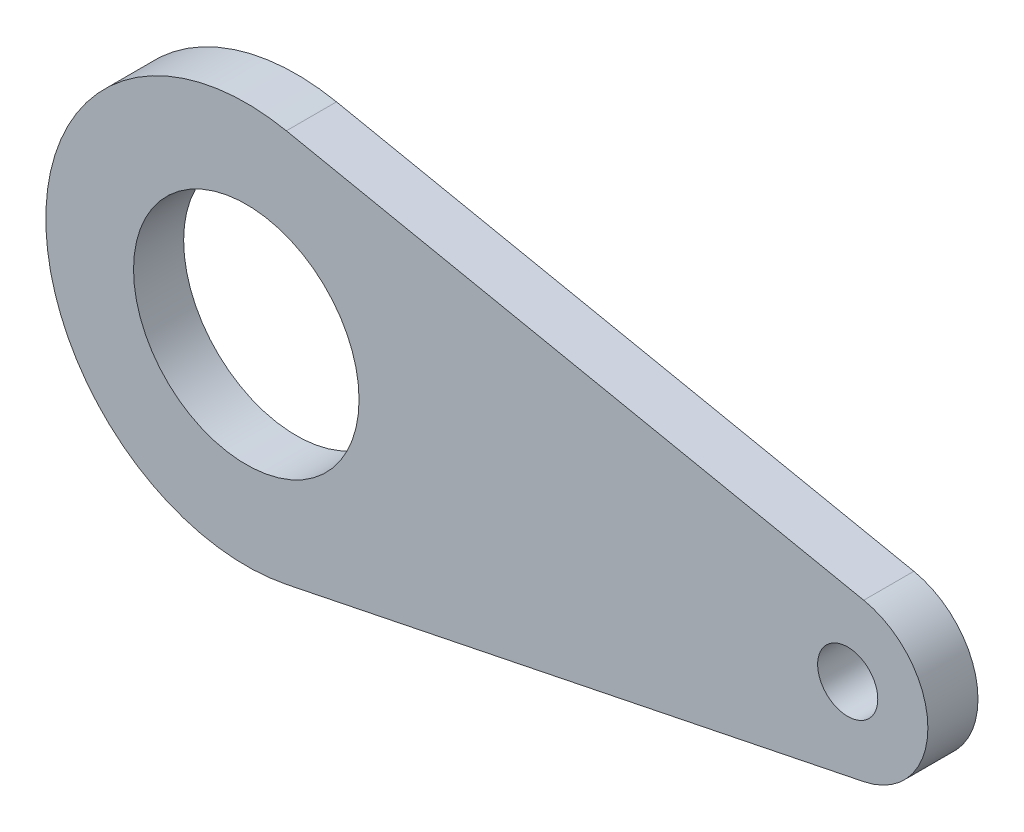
ISO-10303-21;
HEADER;
FILE_DESCRIPTION(('STEP AP214'),'2;1');
FILE_NAME('part.step','',(''),(''),'','','');
FILE_SCHEMA(('AUTOMOTIVE_DESIGN { 1 0 10303 214 1 1 1 1 }'));
ENDSEC;
DATA;
#1=APPLICATION_CONTEXT('core data for automotive mechanical design processes');
#2=APPLICATION_PROTOCOL_DEFINITION('international standard','automotive_design',2000,#1);
#3=PRODUCT_CONTEXT('',#1,'mechanical');
#4=PRODUCT('Part','Part','',(#3));
#5=PRODUCT_RELATED_PRODUCT_CATEGORY('part','',(#4));
#6=PRODUCT_DEFINITION_FORMATION('','',#4);
#7=PRODUCT_DEFINITION_CONTEXT('part definition',#1,'design');
#8=PRODUCT_DEFINITION('design','',#6,#7);
#9=PRODUCT_DEFINITION_SHAPE('','',#8);
#10=(LENGTH_UNIT() NAMED_UNIT(*) SI_UNIT(.MILLI.,.METRE.));
#11=(NAMED_UNIT(*) PLANE_ANGLE_UNIT() SI_UNIT($,.RADIAN.));
#12=(NAMED_UNIT(*) SI_UNIT($,.STERADIAN.) SOLID_ANGLE_UNIT());
#13=UNCERTAINTY_MEASURE_WITH_UNIT(LENGTH_MEASURE(1.E-05),#10,'distance_accuracy_value','');
#14=(GEOMETRIC_REPRESENTATION_CONTEXT(3) GLOBAL_UNCERTAINTY_ASSIGNED_CONTEXT((#13)) GLOBAL_UNIT_ASSIGNED_CONTEXT((#10,
#11,#12)) REPRESENTATION_CONTEXT('',''));
#15=CARTESIAN_POINT('',(0.,0.,0.));
#16=DIRECTION('',(0.,0.,1.));
#17=DIRECTION('',(1.,0.,0.));
#18=AXIS2_PLACEMENT_3D('',#15,#16,#17);
#19=CARTESIAN_POINT('',(0.,0.,5.));
#20=DIRECTION('',(0.,0.,1.));
#21=DIRECTION('',(1.,0.,0.));
#22=AXIS2_PLACEMENT_3D('',#19,#20,#21);
#23=PLANE('',#22);
#24=CARTESIAN_POINT('',(120.,0.,5.));
#25=DIRECTION('',(0.,0.,1.));
#26=DIRECTION('',(1.,0.,0.));
#27=AXIS2_PLACEMENT_3D('',#24,#25,#26);
#28=CIRCLE('',#27,6.00000000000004);
#29=CARTESIAN_POINT('',(126.,0.,5.));
#30=VERTEX_POINT('',#29);
#31=EDGE_CURVE('E90',#30,#30,#28,.T.);
#32=ORIENTED_EDGE('',*,*,#31,.F.);
#33=EDGE_LOOP('',(#32));
#34=FACE_BOUND('',#33,.T.);
#35=CARTESIAN_POINT('',(0.,0.,5.));
#36=DIRECTION('',(0.,0.,1.));
#37=DIRECTION('',(1.,0.,0.));
#38=AXIS2_PLACEMENT_3D('',#35,#36,#37);
#39=CIRCLE('',#38,40.);
#40=CARTESIAN_POINT('',(8.00000000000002,39.1918358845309,5.));
#41=VERTEX_POINT('',#40);
#42=CARTESIAN_POINT('',(8.00000000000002,-39.1918358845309,5.));
#43=VERTEX_POINT('',#42);
#44=EDGE_CURVE('E100',#41,#43,#39,.T.);
#45=ORIENTED_EDGE('',*,*,#44,.T.);
#46=DIRECTION('',(0.979795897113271,0.2,0.));
#47=VECTOR('',#46,1.);
#48=CARTESIAN_POINT('',(8.00000000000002,-39.1918358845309,5.));
#49=LINE('',#48,#47);
#50=CARTESIAN_POINT('',(123.2,-15.6767343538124,5.));
#51=VERTEX_POINT('',#50);
#52=EDGE_CURVE('E85',#43,#51,#49,.T.);
#53=ORIENTED_EDGE('',*,*,#52,.T.);
#54=CARTESIAN_POINT('',(120.,0.,5.));
#55=DIRECTION('',(0.,0.,1.));
#56=DIRECTION('',(1.,0.,0.));
#57=AXIS2_PLACEMENT_3D('',#54,#55,#56);
#58=CIRCLE('',#57,16.);
#59=CARTESIAN_POINT('',(123.2,15.6767343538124,5.));
#60=VERTEX_POINT('',#59);
#61=EDGE_CURVE('E51',#51,#60,#58,.T.);
#62=ORIENTED_EDGE('',*,*,#61,.T.);
#63=DIRECTION('',(-0.979795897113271,0.2,0.));
#64=VECTOR('',#63,1.);
#65=CARTESIAN_POINT('',(8.00000000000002,39.1918358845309,5.));
#66=LINE('',#65,#64);
#67=EDGE_CURVE('E46',#60,#41,#66,.T.);
#68=ORIENTED_EDGE('',*,*,#67,.T.);
#69=EDGE_LOOP('',(#45,#53,#62,#68));
#70=FACE_BOUND('',#69,.T.);
#71=CARTESIAN_POINT('',(0.,0.,5.));
#72=DIRECTION('',(0.,0.,1.));
#73=DIRECTION('',(1.,0.,0.));
#74=AXIS2_PLACEMENT_3D('',#71,#72,#73);
#75=CIRCLE('',#74,22.5);
#76=CARTESIAN_POINT('',(22.5,0.,5.));
#77=VERTEX_POINT('',#76);
#78=EDGE_CURVE('E118',#77,#77,#75,.T.);
#79=ORIENTED_EDGE('',*,*,#78,.F.);
#80=EDGE_LOOP('',(#79));
#81=FACE_BOUND('',#80,.T.);
#82=ADVANCED_FACE('F31',(#34,#70,#81),#23,.T.);
#83=CARTESIAN_POINT('',(0.,0.,-5.));
#84=DIRECTION('',(0.,0.,1.));
#85=DIRECTION('',(1.,0.,0.));
#86=AXIS2_PLACEMENT_3D('',#83,#84,#85);
#87=PLANE('',#86);
#88=CARTESIAN_POINT('',(120.,0.,-5.));
#89=DIRECTION('',(0.,0.,1.));
#90=DIRECTION('',(1.,0.,0.));
#91=AXIS2_PLACEMENT_3D('',#88,#89,#90);
#92=CIRCLE('',#91,6.00000000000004);
#93=CARTESIAN_POINT('',(126.,0.,-5.));
#94=VERTEX_POINT('',#93);
#95=EDGE_CURVE('E93',#94,#94,#92,.T.);
#96=ORIENTED_EDGE('',*,*,#95,.T.);
#97=EDGE_LOOP('',(#96));
#98=FACE_BOUND('',#97,.T.);
#99=CARTESIAN_POINT('',(0.,0.,-5.));
#100=DIRECTION('',(0.,0.,1.));
#101=DIRECTION('',(1.,0.,0.));
#102=AXIS2_PLACEMENT_3D('',#99,#100,#101);
#103=CIRCLE('',#102,40.);
#104=CARTESIAN_POINT('',(8.00000000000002,39.1918358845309,-5.));
#105=VERTEX_POINT('',#104);
#106=CARTESIAN_POINT('',(8.00000000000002,-39.1918358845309,-5.));
#107=VERTEX_POINT('',#106);
#108=EDGE_CURVE('E77',#105,#107,#103,.T.);
#109=ORIENTED_EDGE('',*,*,#108,.F.);
#110=DIRECTION('',(-0.979795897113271,0.2,0.));
#111=VECTOR('',#110,1.);
#112=CARTESIAN_POINT('',(8.00000000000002,39.1918358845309,-5.));
#113=LINE('',#112,#111);
#114=CARTESIAN_POINT('',(123.2,15.6767343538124,-5.));
#115=VERTEX_POINT('',#114);
#116=EDGE_CURVE('E98',#115,#105,#113,.T.);
#117=ORIENTED_EDGE('',*,*,#116,.F.);
#118=CARTESIAN_POINT('',(120.,0.,-5.));
#119=DIRECTION('',(0.,0.,1.));
#120=DIRECTION('',(1.,0.,0.));
#121=AXIS2_PLACEMENT_3D('',#118,#119,#120);
#122=CIRCLE('',#121,16.);
#123=CARTESIAN_POINT('',(123.2,-15.6767343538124,-5.));
#124=VERTEX_POINT('',#123);
#125=EDGE_CURVE('E78',#124,#115,#122,.T.);
#126=ORIENTED_EDGE('',*,*,#125,.F.);
#127=DIRECTION('',(0.979795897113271,0.2,0.));
#128=VECTOR('',#127,1.);
#129=CARTESIAN_POINT('',(8.00000000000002,-39.1918358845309,-5.));
#130=LINE('',#129,#128);
#131=EDGE_CURVE('E72',#107,#124,#130,.T.);
#132=ORIENTED_EDGE('',*,*,#131,.F.);
#133=EDGE_LOOP('',(#109,#117,#126,#132));
#134=FACE_BOUND('',#133,.T.);
#135=CARTESIAN_POINT('',(0.,0.,-5.));
#136=DIRECTION('',(0.,0.,1.));
#137=DIRECTION('',(1.,0.,0.));
#138=AXIS2_PLACEMENT_3D('',#135,#136,#137);
#139=CIRCLE('',#138,22.5);
#140=CARTESIAN_POINT('',(22.5,0.,-5.));
#141=VERTEX_POINT('',#140);
#142=EDGE_CURVE('E120',#141,#141,#139,.T.);
#143=ORIENTED_EDGE('',*,*,#142,.T.);
#144=EDGE_LOOP('',(#143));
#145=FACE_BOUND('',#144,.T.);
#146=ADVANCED_FACE('F73',(#98,#134,#145),#87,.F.);
#147=CARTESIAN_POINT('',(0.,0.,5.));
#148=DIRECTION('',(0.,0.,-1.));
#149=DIRECTION('',(-1.,0.,0.));
#150=AXIS2_PLACEMENT_3D('',#147,#148,#149);
#151=CYLINDRICAL_SURFACE('',#150,40.);
#152=ORIENTED_EDGE('',*,*,#108,.T.);
#153=DIRECTION('',(0.,0.,-1.));
#154=VECTOR('',#153,1.);
#155=CARTESIAN_POINT('',(8.00000000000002,-39.1918358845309,5.));
#156=LINE('',#155,#154);
#157=EDGE_CURVE('E11',#43,#107,#156,.T.);
#158=ORIENTED_EDGE('',*,*,#157,.F.);
#159=ORIENTED_EDGE('',*,*,#44,.F.);
#160=DIRECTION('',(0.,0.,-1.));
#161=VECTOR('',#160,1.);
#162=CARTESIAN_POINT('',(8.00000000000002,39.1918358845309,5.));
#163=LINE('',#162,#161);
#164=EDGE_CURVE('E89',#41,#105,#163,.T.);
#165=ORIENTED_EDGE('',*,*,#164,.T.);
#166=EDGE_LOOP('',(#152,#158,#159,#165));
#167=FACE_BOUND('',#166,.T.);
#168=ADVANCED_FACE('F33',(#167),#151,.T.);
#169=CARTESIAN_POINT('',(8.00000000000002,-39.1918358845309,5.));
#170=DIRECTION('',(-0.2,0.979795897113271,0.));
#171=DIRECTION('',(-0.979795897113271,-0.2,0.));
#172=AXIS2_PLACEMENT_3D('',#169,#170,#171);
#173=PLANE('',#172);
#174=ORIENTED_EDGE('',*,*,#131,.T.);
#175=DIRECTION('',(0.,0.,-1.));
#176=VECTOR('',#175,1.);
#177=CARTESIAN_POINT('',(123.2,-15.6767343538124,5.));
#178=LINE('',#177,#176);
#179=EDGE_CURVE('E39',#51,#124,#178,.T.);
#180=ORIENTED_EDGE('',*,*,#179,.F.);
#181=ORIENTED_EDGE('',*,*,#52,.F.);
#182=ORIENTED_EDGE('',*,*,#157,.T.);
#183=EDGE_LOOP('',(#174,#180,#181,#182));
#184=FACE_BOUND('',#183,.T.);
#185=ADVANCED_FACE('F84',(#184),#173,.F.);
#186=CARTESIAN_POINT('',(120.,0.,5.));
#187=DIRECTION('',(0.,0.,-1.));
#188=DIRECTION('',(-1.,0.,0.));
#189=AXIS2_PLACEMENT_3D('',#186,#187,#188);
#190=CYLINDRICAL_SURFACE('',#189,16.);
#191=ORIENTED_EDGE('',*,*,#125,.T.);
#192=DIRECTION('',(0.,0.,-1.));
#193=VECTOR('',#192,1.);
#194=CARTESIAN_POINT('',(123.2,15.6767343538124,5.));
#195=LINE('',#194,#193);
#196=EDGE_CURVE('E106',#60,#115,#195,.T.);
#197=ORIENTED_EDGE('',*,*,#196,.F.);
#198=ORIENTED_EDGE('',*,*,#61,.F.);
#199=ORIENTED_EDGE('',*,*,#179,.T.);
#200=EDGE_LOOP('',(#191,#197,#198,#199));
#201=FACE_BOUND('',#200,.T.);
#202=ADVANCED_FACE('F109',(#201),#190,.T.);
#203=CARTESIAN_POINT('',(8.00000000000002,39.1918358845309,5.));
#204=DIRECTION('',(-0.2,-0.979795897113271,0.));
#205=DIRECTION('',(0.979795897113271,-0.2,0.));
#206=AXIS2_PLACEMENT_3D('',#203,#204,#205);
#207=PLANE('',#206);
#208=ORIENTED_EDGE('',*,*,#116,.T.);
#209=ORIENTED_EDGE('',*,*,#164,.F.);
#210=ORIENTED_EDGE('',*,*,#67,.F.);
#211=ORIENTED_EDGE('',*,*,#196,.T.);
#212=EDGE_LOOP('',(#208,#209,#210,#211));
#213=FACE_BOUND('',#212,.T.);
#214=ADVANCED_FACE('F111',(#213),#207,.F.);
#215=CARTESIAN_POINT('',(120.,0.,5.));
#216=DIRECTION('',(0.,0.,-1.));
#217=DIRECTION('',(-1.,0.,0.));
#218=AXIS2_PLACEMENT_3D('',#215,#216,#217);
#219=CYLINDRICAL_SURFACE('',#218,6.00000000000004);
#220=ORIENTED_EDGE('',*,*,#31,.T.);
#221=EDGE_LOOP('',(#220));
#222=FACE_BOUND('',#221,.T.);
#223=ORIENTED_EDGE('',*,*,#95,.F.);
#224=EDGE_LOOP('',(#223));
#225=FACE_BOUND('',#224,.T.);
#226=ADVANCED_FACE('F129',(#222,#225),#219,.F.);
#227=CARTESIAN_POINT('',(0.,0.,5.));
#228=DIRECTION('',(0.,0.,-1.));
#229=DIRECTION('',(-1.,0.,0.));
#230=AXIS2_PLACEMENT_3D('',#227,#228,#229);
#231=CYLINDRICAL_SURFACE('',#230,22.5);
#232=ORIENTED_EDGE('',*,*,#78,.T.);
#233=EDGE_LOOP('',(#232));
#234=FACE_BOUND('',#233,.T.);
#235=ORIENTED_EDGE('',*,*,#142,.F.);
#236=EDGE_LOOP('',(#235));
#237=FACE_BOUND('',#236,.T.);
#238=ADVANCED_FACE('F127',(#234,#237),#231,.F.);
#239=CLOSED_SHELL('',(#82,#146,#168,#185,#202,#214,#226,#238));
#240=MANIFOLD_SOLID_BREP('B2',#239);
#241=ADVANCED_BREP_SHAPE_REPRESENTATION('',(#18,#240),#14);
#242=SHAPE_DEFINITION_REPRESENTATION(#9,#241);
ENDSEC;
END-ISO-10303-21;
